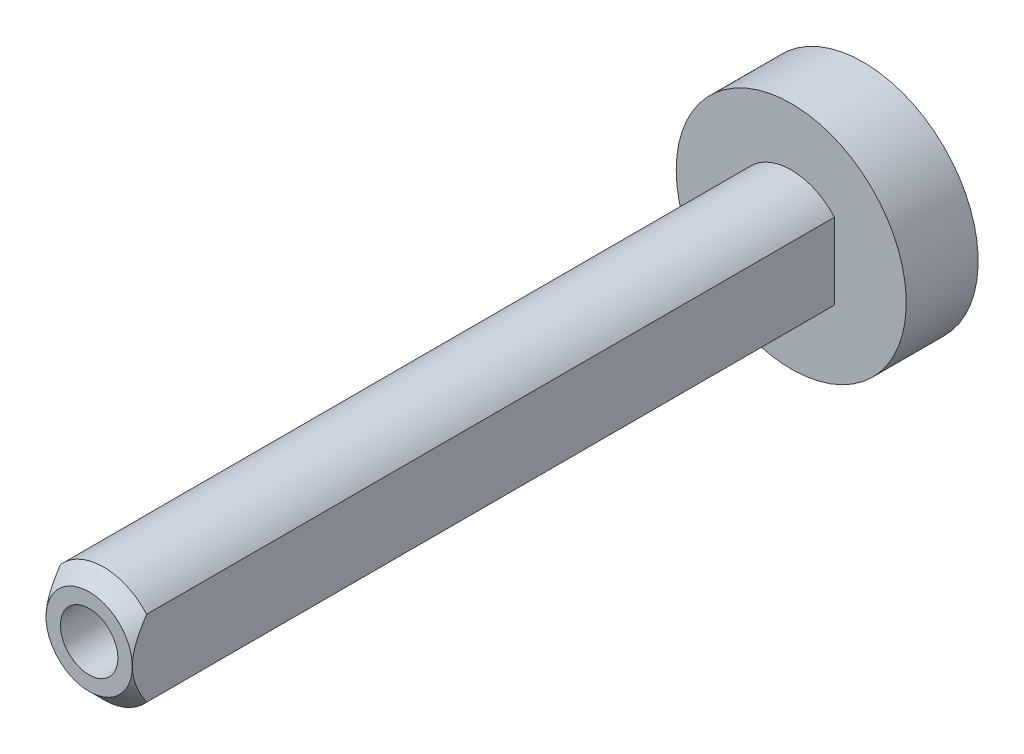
from build123d import *

# Parameters (mm, degrees)
SKETCH1_R             = 4
BASE_EXTRUDE_DEPTH    = 53.83
CHAMFER1_SIZE         = 1
SKETCH2_R             = 2
INTERNAL_THREAD_DEPTH = 8
WRENCH_FLATS_DEPTH    = 55.126415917
BACK_CUT_DEPTH        = 1
SKETCH5_R             = 8
PISTON_DEPTH          = 5


with BuildPart() as part:
    # Sketch1 → Base-Extrude (new body)
    with BuildSketch(Plane.XY):
        Circle(SKETCH1_R)
    extrude(amount=BASE_EXTRUDE_DEPTH)

    # Chamfer1
    chamfer1_edges = [part.edges().sort_by_distance(p)[0] for p in [
        (-4, 0, 53.83),
    ]]
    chamfer(chamfer1_edges, length=CHAMFER1_SIZE)

    # Sketch2 → Internal Thread (cut)
    with BuildSketch(Plane.XY.offset(53.83)):
        Circle(SKETCH2_R)
    extrude(amount=-INTERNAL_THREAD_DEPTH, mode=Mode.SUBTRACT)

    # Sketch3 → Wrench Flats (cut, through all)
    with BuildSketch(Plane(origin=(0, 0, 0), x_dir=(-1, 0, 0), z_dir=(0, 0, -1))):
        with BuildLine():
            Line((3, 2.645751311), (3, -2.645751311))
            ThreePointArc((3, -2.645751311), (4, 0), (3, 2.645751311))
        make_face()
        with BuildLine():
            Line((-3, 2.645751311), (-3, -2.645751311))
            ThreePointArc((-3, -2.645751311), (-4, 0), (-3, 2.645751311))
        make_face()
    extrude(amount=-WRENCH_FLATS_DEPTH, mode=Mode.SUBTRACT)

    # Sketch4 → Back Cut (cut)
    with BuildSketch(Plane(origin=(0, 0, 0), x_dir=(-1, 0, 0), z_dir=(0, 0, -1))):
        with BuildLine():
            Line((-3, 2.645751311), (-3, -2.645751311))
            ThreePointArc((-3, -2.645751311), (0, -4), (3, -2.645751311))
            Line((3, -2.645751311), (3, 2.645751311))
            ThreePointArc((3, 2.645751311), (0, 4), (-3, 2.645751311))
        make_face()
        with BuildLine():
            Line((-2, 2.236067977), (-2, -2.236067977))
            ThreePointArc((-2, -2.236067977), (0, -3), (2, -2.236067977))
            Line((2, -2.236067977), (2, 2.236067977))
            ThreePointArc((2, 2.236067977), (0, 3), (-2, 2.236067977))
        make_face(mode=Mode.SUBTRACT)
    extrude(amount=-BACK_CUT_DEPTH, mode=Mode.SUBTRACT)

    # Sketch5 → Piston (add)
    with BuildSketch(Plane(origin=(0, 0, 0), x_dir=(-1, 0, 0), z_dir=(0, 0, -1))):
        Circle(SKETCH5_R)
        with BuildLine():
            Line((-3, 2.645751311), (-3, -2.645751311))
            ThreePointArc((-3, -2.645751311), (0, -4), (3, -2.645751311))
            Line((3, -2.645751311), (3, 2.645751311))
            ThreePointArc((3, 2.645751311), (0, 4), (-3, 2.645751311))
        make_face(mode=Mode.SUBTRACT)
    extrude(amount=-PISTON_DEPTH)


solid = part.part
